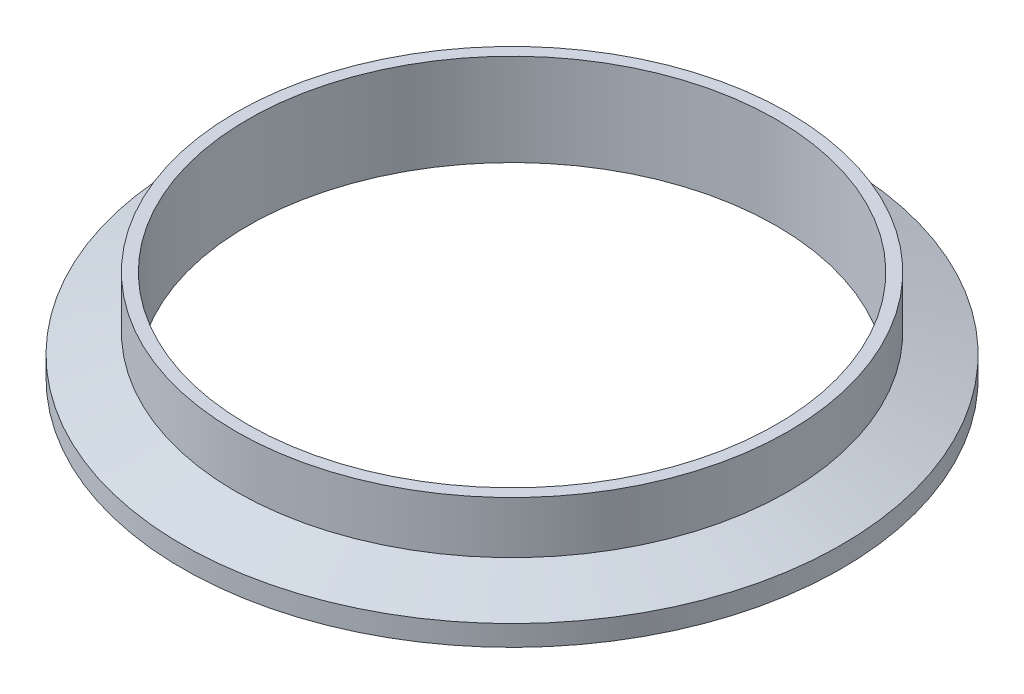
ISO-10303-21;
HEADER;
FILE_DESCRIPTION(('STEP AP214'),'2;1');
FILE_NAME('part.step','',(''),(''),'','','');
FILE_SCHEMA(('AUTOMOTIVE_DESIGN { 1 0 10303 214 1 1 1 1 }'));
ENDSEC;
DATA;
#1=APPLICATION_CONTEXT('core data for automotive mechanical design processes');
#2=APPLICATION_PROTOCOL_DEFINITION('international standard','automotive_design',2000,#1);
#3=PRODUCT_CONTEXT('',#1,'mechanical');
#4=PRODUCT('Part','Part','',(#3));
#5=PRODUCT_RELATED_PRODUCT_CATEGORY('part','',(#4));
#6=PRODUCT_DEFINITION_FORMATION('','',#4);
#7=PRODUCT_DEFINITION_CONTEXT('part definition',#1,'design');
#8=PRODUCT_DEFINITION('design','',#6,#7);
#9=PRODUCT_DEFINITION_SHAPE('','',#8);
#10=(LENGTH_UNIT() NAMED_UNIT(*) SI_UNIT(.MILLI.,.METRE.));
#11=(NAMED_UNIT(*) PLANE_ANGLE_UNIT() SI_UNIT($,.RADIAN.));
#12=(NAMED_UNIT(*) SI_UNIT($,.STERADIAN.) SOLID_ANGLE_UNIT());
#13=UNCERTAINTY_MEASURE_WITH_UNIT(LENGTH_MEASURE(1.E-05),#10,'distance_accuracy_value','');
#14=(GEOMETRIC_REPRESENTATION_CONTEXT(3) GLOBAL_UNCERTAINTY_ASSIGNED_CONTEXT((#13)) GLOBAL_UNIT_ASSIGNED_CONTEXT((#10,
#11,#12)) REPRESENTATION_CONTEXT('',''));
#15=CARTESIAN_POINT('',(0.,0.,0.));
#16=DIRECTION('',(0.,0.,1.));
#17=DIRECTION('',(1.,0.,0.));
#18=AXIS2_PLACEMENT_3D('',#15,#16,#17);
#19=CARTESIAN_POINT('',(1.66533453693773E-13,0.787399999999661,0.));
#20=DIRECTION('',(0.,-1.00000000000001,0.));
#21=DIRECTION('',(0.,0.,-1.));
#22=AXIS2_PLACEMENT_3D('',#19,#20,#21);
#23=TOROIDAL_SURFACE('',#22,43.4867084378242,0.787400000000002);
#24=CARTESIAN_POINT('',(0.,0.,0.));
#25=DIRECTION('',(0.,-1.00000000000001,0.));
#26=DIRECTION('',(0.,0.,-1.));
#27=AXIS2_PLACEMENT_3D('',#24,#25,#26);
#28=CIRCLE('',#27,43.4867084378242);
#29=CARTESIAN_POINT('',(0.,0.,-43.4867084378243));
#30=VERTEX_POINT('',#29);
#31=EDGE_CURVE('E75',#30,#30,#28,.T.);
#32=ORIENTED_EDGE('',*,*,#31,.T.);
#33=EDGE_LOOP('',(#32));
#34=FACE_BOUND('',#33,.T.);
#35=CARTESIAN_POINT('',(-2.22044604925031E-13,0.474458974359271,8.04911692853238E-13));
#36=DIRECTION('',(0.,-1.00000000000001,0.));
#37=DIRECTION('',(0.,0.,-1.));
#38=AXIS2_PLACEMENT_3D('',#35,#36,#37);
#39=CIRCLE('',#38,42.7641666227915);
#40=CARTESIAN_POINT('',(-2.17296828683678E-13,0.474458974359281,-42.7641666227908));
#41=VERTEX_POINT('',#40);
#42=EDGE_CURVE('E10',#41,#41,#39,.T.);
#43=ORIENTED_EDGE('',*,*,#42,.F.);
#44=EDGE_LOOP('',(#43));
#45=FACE_BOUND('',#44,.T.);
#46=ADVANCED_FACE('F32',(#34,#45),#23,.T.);
#47=CARTESIAN_POINT('',(0.,0.,0.));
#48=DIRECTION('',(0.,-1.00000000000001,0.));
#49=DIRECTION('',(0.,0.,-1.));
#50=AXIS2_PLACEMENT_3D('',#47,#48,#49);
#51=TOROIDAL_SURFACE('',#50,41.6687,1.1938);
#52=CARTESIAN_POINT('',(-2.22044604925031E-13,0.474458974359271,8.04911692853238E-13));
#53=DIRECTION('',(0.,-1.00000000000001,0.));
#54=DIRECTION('',(0.,0.,-1.));
#55=AXIS2_PLACEMENT_3D('',#52,#53,#54);
#56=CIRCLE('',#55,40.5732333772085);
#57=CARTESIAN_POINT('',(-2.17540071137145E-13,0.47445897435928,-40.5732333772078));
#58=VERTEX_POINT('',#57);
#59=EDGE_CURVE('E39',#58,#58,#56,.T.);
#60=ORIENTED_EDGE('',*,*,#59,.F.);
#61=EDGE_LOOP('',(#60));
#62=FACE_BOUND('',#61,.T.);
#63=ORIENTED_EDGE('',*,*,#42,.T.);
#64=EDGE_LOOP('',(#63));
#65=FACE_BOUND('',#64,.T.);
#66=ADVANCED_FACE('F124',(#62,#65),#51,.F.);
#67=CARTESIAN_POINT('',(1.66533453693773E-13,0.787399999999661,0.));
#68=DIRECTION('',(0.,-1.00000000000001,0.));
#69=DIRECTION('',(0.,0.,-1.));
#70=AXIS2_PLACEMENT_3D('',#67,#68,#69);
#71=TOROIDAL_SURFACE('',#70,39.8506915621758,0.787399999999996);
#72=ORIENTED_EDGE('',*,*,#59,.T.);
#73=EDGE_LOOP('',(#72));
#74=FACE_BOUND('',#73,.T.);
#75=CARTESIAN_POINT('',(0.,0.,0.));
#76=DIRECTION('',(0.,-1.00000000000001,0.));
#77=DIRECTION('',(0.,0.,-1.));
#78=AXIS2_PLACEMENT_3D('',#75,#76,#77);
#79=CIRCLE('',#78,39.8506915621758);
#80=CARTESIAN_POINT('',(0.,0.,-39.8506915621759));
#81=VERTEX_POINT('',#80);
#82=EDGE_CURVE('E45',#81,#81,#79,.T.);
#83=ORIENTED_EDGE('',*,*,#82,.F.);
#84=EDGE_LOOP('',(#83));
#85=FACE_BOUND('',#84,.T.);
#86=ADVANCED_FACE('F120',(#74,#85),#71,.T.);
#87=CARTESIAN_POINT('',(0.,0.,0.));
#88=DIRECTION('',(0.,1.00000000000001,0.));
#89=DIRECTION('',(0.,0.,1.));
#90=AXIS2_PLACEMENT_3D('',#87,#88,#89);
#91=PLANE('',#90);
#92=CARTESIAN_POINT('',(0.,0.,0.));
#93=DIRECTION('',(0.,-1.00000000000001,0.));
#94=DIRECTION('',(0.,0.,-1.));
#95=AXIS2_PLACEMENT_3D('',#92,#93,#94);
#96=CIRCLE('',#95,36.449);
#97=CARTESIAN_POINT('',(0.,0.,-36.4490000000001));
#98=VERTEX_POINT('',#97);
#99=EDGE_CURVE('E51',#98,#98,#96,.T.);
#100=ORIENTED_EDGE('',*,*,#99,.F.);
#101=EDGE_LOOP('',(#100));
#102=FACE_BOUND('',#101,.T.);
#103=ORIENTED_EDGE('',*,*,#82,.T.);
#104=EDGE_LOOP('',(#103));
#105=FACE_BOUND('',#104,.T.);
#106=ADVANCED_FACE('F114',(#102,#105),#91,.F.);
#107=CARTESIAN_POINT('',(0.,0.,0.));
#108=DIRECTION('',(0.,-1.00000000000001,0.));
#109=DIRECTION('',(0.,0.,-1.));
#110=AXIS2_PLACEMENT_3D('',#107,#108,#109);
#111=CYLINDRICAL_SURFACE('',#110,36.449);
#112=ORIENTED_EDGE('',*,*,#99,.T.);
#113=EDGE_LOOP('',(#112));
#114=FACE_BOUND('',#113,.T.);
#115=CARTESIAN_POINT('',(-9.43689570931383E-13,12.7000000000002,0.));
#116=DIRECTION('',(0.,-1.00000000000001,0.));
#117=DIRECTION('',(0.,0.,-1.));
#118=AXIS2_PLACEMENT_3D('',#115,#116,#117);
#119=CIRCLE('',#118,36.449);
#120=CARTESIAN_POINT('',(-9.39642919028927E-13,12.7000000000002,-36.4490000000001));
#121=VERTEX_POINT('',#120);
#122=EDGE_CURVE('E57',#121,#121,#119,.T.);
#123=ORIENTED_EDGE('',*,*,#122,.F.);
#124=EDGE_LOOP('',(#123));
#125=FACE_BOUND('',#124,.T.);
#126=ADVANCED_FACE('F109',(#114,#125),#111,.F.);
#127=CARTESIAN_POINT('',(-9.43689570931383E-13,12.7000000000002,0.));
#128=DIRECTION('',(0.,-1.00000000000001,0.));
#129=DIRECTION('',(0.,0.,-1.));
#130=AXIS2_PLACEMENT_3D('',#127,#128,#129);
#131=PLANE('',#130);
#132=CARTESIAN_POINT('',(-9.43689570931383E-13,12.7000000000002,0.));
#133=DIRECTION('',(0.,-1.00000000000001,0.));
#134=DIRECTION('',(0.,0.,-1.));
#135=AXIS2_PLACEMENT_3D('',#132,#133,#134);
#136=CIRCLE('',#135,38.1);
#137=CARTESIAN_POINT('',(-9.39459621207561E-13,12.7000000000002,-38.1000000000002));
#138=VERTEX_POINT('',#137);
#139=EDGE_CURVE('E61',#138,#138,#136,.T.);
#140=ORIENTED_EDGE('',*,*,#139,.F.);
#141=EDGE_LOOP('',(#140));
#142=FACE_BOUND('',#141,.T.);
#143=ORIENTED_EDGE('',*,*,#122,.T.);
#144=EDGE_LOOP('',(#143));
#145=FACE_BOUND('',#144,.T.);
#146=ADVANCED_FACE('F103',(#142,#145),#131,.F.);
#147=CARTESIAN_POINT('',(0.,0.,0.));
#148=DIRECTION('',(0.,-1.00000000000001,0.));
#149=DIRECTION('',(0.,0.,-1.));
#150=AXIS2_PLACEMENT_3D('',#147,#148,#149);
#151=CYLINDRICAL_SURFACE('',#150,38.1);
#152=CARTESIAN_POINT('',(0.,5.52118232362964,3.05311331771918E-13));
#153=DIRECTION('',(0.,-1.00000000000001,0.));
#154=DIRECTION('',(0.,0.,-1.));
#155=AXIS2_PLACEMENT_3D('',#152,#153,#154);
#156=CIRCLE('',#155,38.1);
#157=CARTESIAN_POINT('',(0.,5.52118232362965,-38.0999999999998));
#158=VERTEX_POINT('',#157);
#159=EDGE_CURVE('E64',#158,#158,#156,.T.);
#160=ORIENTED_EDGE('',*,*,#159,.F.);
#161=EDGE_LOOP('',(#160));
#162=FACE_BOUND('',#161,.T.);
#163=ORIENTED_EDGE('',*,*,#139,.T.);
#164=EDGE_LOOP('',(#163));
#165=FACE_BOUND('',#164,.T.);
#166=ADVANCED_FACE('F97',(#162,#165),#151,.T.);
#167=CARTESIAN_POINT('',(0.,5.52118232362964,3.05311331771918E-13));
#168=DIRECTION('',(0.,-1.00000000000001,0.));
#169=DIRECTION('',(0.,0.,-1.));
#170=AXIS2_PLACEMENT_3D('',#167,#168,#169);
#171=CONICAL_SURFACE('',#170,38.1,1.22173047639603);
#172=CARTESIAN_POINT('',(0.,2.84480000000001,-3.88578058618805E-13));
#173=DIRECTION('',(0.,-1.00000000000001,0.));
#174=DIRECTION('',(0.,0.,-1.));
#175=AXIS2_PLACEMENT_3D('',#172,#173,#174);
#176=CIRCLE('',#175,45.4533);
#177=CARTESIAN_POINT('',(0.,2.84480000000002,-45.4533000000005));
#178=VERTEX_POINT('',#177);
#179=EDGE_CURVE('E68',#178,#178,#176,.T.);
#180=ORIENTED_EDGE('',*,*,#179,.F.);
#181=EDGE_LOOP('',(#180));
#182=FACE_BOUND('',#181,.T.);
#183=ORIENTED_EDGE('',*,*,#159,.T.);
#184=EDGE_LOOP('',(#183));
#185=FACE_BOUND('',#184,.T.);
#186=ADVANCED_FACE('F91',(#182,#185),#171,.T.);
#187=CARTESIAN_POINT('',(0.,0.,0.));
#188=DIRECTION('',(0.,-1.00000000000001,0.));
#189=DIRECTION('',(0.,0.,-1.));
#190=AXIS2_PLACEMENT_3D('',#187,#188,#189);
#191=CYLINDRICAL_SURFACE('',#190,45.4533);
#192=CARTESIAN_POINT('',(0.,0.,0.));
#193=DIRECTION('',(0.,-1.00000000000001,0.));
#194=DIRECTION('',(0.,0.,-1.));
#195=AXIS2_PLACEMENT_3D('',#192,#193,#194);
#196=CIRCLE('',#195,45.4533);
#197=CARTESIAN_POINT('',(0.,0.,-45.4533000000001));
#198=VERTEX_POINT('',#197);
#199=EDGE_CURVE('E71',#198,#198,#196,.T.);
#200=ORIENTED_EDGE('',*,*,#199,.F.);
#201=EDGE_LOOP('',(#200));
#202=FACE_BOUND('',#201,.T.);
#203=ORIENTED_EDGE('',*,*,#179,.T.);
#204=EDGE_LOOP('',(#203));
#205=FACE_BOUND('',#204,.T.);
#206=ADVANCED_FACE('F85',(#202,#205),#191,.T.);
#207=CARTESIAN_POINT('',(0.,0.,0.));
#208=DIRECTION('',(0.,1.00000000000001,0.));
#209=DIRECTION('',(0.,0.,1.));
#210=AXIS2_PLACEMENT_3D('',#207,#208,#209);
#211=PLANE('',#210);
#212=ORIENTED_EDGE('',*,*,#31,.F.);
#213=EDGE_LOOP('',(#212));
#214=FACE_BOUND('',#213,.T.);
#215=ORIENTED_EDGE('',*,*,#199,.T.);
#216=EDGE_LOOP('',(#215));
#217=FACE_BOUND('',#216,.T.);
#218=ADVANCED_FACE('F82',(#214,#217),#211,.F.);
#219=CLOSED_SHELL('',(#46,#66,#86,#106,#126,#146,#166,#186,#206,#218));
#220=MANIFOLD_SOLID_BREP('B2',#219);
#221=ADVANCED_BREP_SHAPE_REPRESENTATION('',(#18,#220),#14);
#222=SHAPE_DEFINITION_REPRESENTATION(#9,#221);
ENDSEC;
END-ISO-10303-21;
